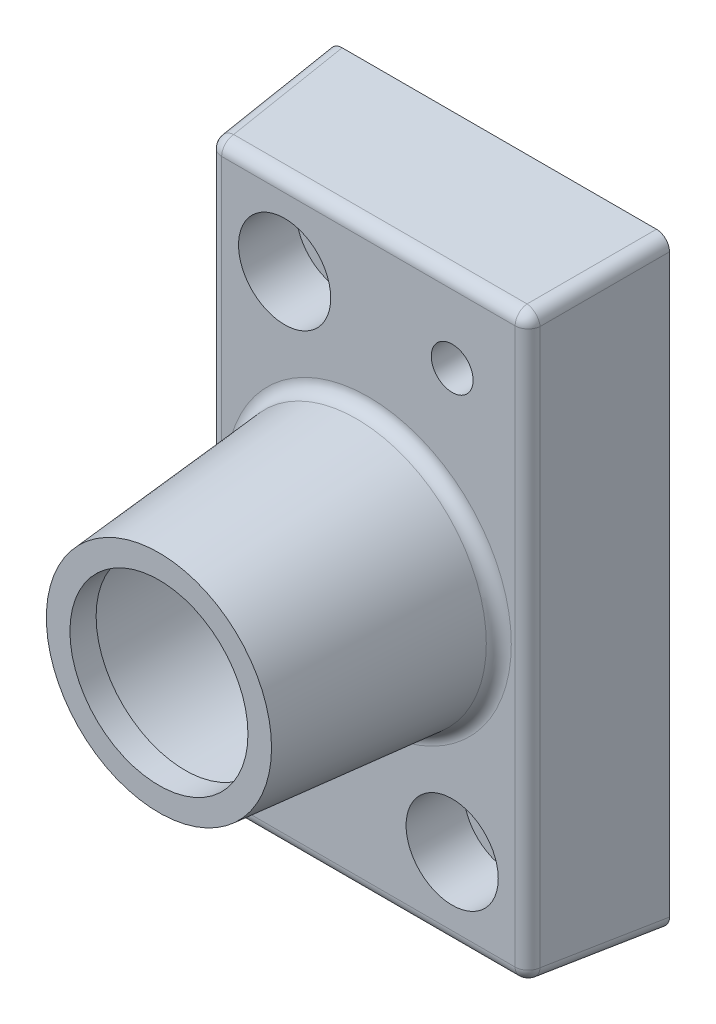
from build123d import *

# Parameters (mm, degrees)
ESQUISSE1_W             = 65
ESQUISSE1_H             = 115
BASE_EXTRUSION_DEPTH    = 25
BASE_EXTRUSION_TAPER    = 5
ESQUISSE2_R             = 25
BOSS_EXTRU_1_DEPTH      = 40
BOSS_EXTRU_1_TAPER      = 5
CONG_1_R                = 2.5
ESQUISSE3_R             = 20
ENL_V_MAT_EXTRU_1_DEPTH = 60
ESQUISSE4_R             = 17
ENL_V_MAT_EXTRU_2_DEPTH = 93.668764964
PER_AGE1_D              = 11
PER_AGE1_CBORE_D        = 17.6
PER_AGE1_CBORE_DEPTH    = 11
ESQUISSE7_R             = 4
ENL_V_MAT_EXTRU_3_DEPTH = 78.217226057


with BuildPart() as part:
    # Esquisse1 → Base-Extrusion (new body)
    with BuildSketch(Plane.XY):
        Rectangle(ESQUISSE1_W, ESQUISSE1_H)
    extrude(amount=BASE_EXTRUSION_DEPTH, taper=BASE_EXTRUSION_TAPER)

    # Esquisse2 → Boss.-Extru.1 (add)
    with BuildSketch(Plane.XY.offset(25)):
        Circle(ESQUISSE2_R)
    extrude(amount=BOSS_EXTRU_1_DEPTH, taper=BOSS_EXTRU_1_TAPER)

    # Cong_1
    cong_1_edges = [part.edges().sort_by_distance(p)[0] for p in [
        (-31.406391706, 56.406391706, 12.5),
        (-31.406391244, -56.406391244, 12.50000528),
        (-30.312783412, 0, 25),
        (31.406391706, -56.406391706, 12.5),
        (0, -55.312783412, 25),
        (31.406391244, 56.406391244, 12.50000528),
        (30.312783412, 0, 25),
        (0, 55.312783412, 25),
        (-25, 0, 25),
    ]]
    fillet(cong_1_edges, radius=CONG_1_R)

    # Esquisse3 → Enl_v. mat.-Extru.1 (cut)
    with BuildSketch(Plane(origin=(0, 0, 0), x_dir=(-1, 0, 0), z_dir=(0, 0, -1))):
        Circle(ESQUISSE3_R)
    extrude(amount=-ENL_V_MAT_EXTRU_1_DEPTH, mode=Mode.SUBTRACT)

    # Esquisse4 → Enl_v. mat.-Extru.2 (cut, through all)
    with BuildSketch(Plane.XY.offset(65)):
        Circle(ESQUISSE4_R)
    extrude(amount=-ENL_V_MAT_EXTRU_2_DEPTH, mode=Mode.SUBTRACT)

    # Per_age1 (through all)
    with Locations(Plane.XY.offset(25)):
        with Locations((16, -40), (-16, 40)):
            CounterBoreHole(PER_AGE1_D / 2, PER_AGE1_CBORE_D / 2, PER_AGE1_CBORE_DEPTH)

    # Esquisse7 → Enl_v. mat.-Extru.3 (cut, through all)
    with BuildSketch(Plane.XY.offset(25)):
        with Locations((16, 40)):
            Circle(ESQUISSE7_R)
        with Locations((-16, -40)):
            Circle(ESQUISSE7_R)
    extrude(amount=-ENL_V_MAT_EXTRU_3_DEPTH, mode=Mode.SUBTRACT)


solid = part.part
